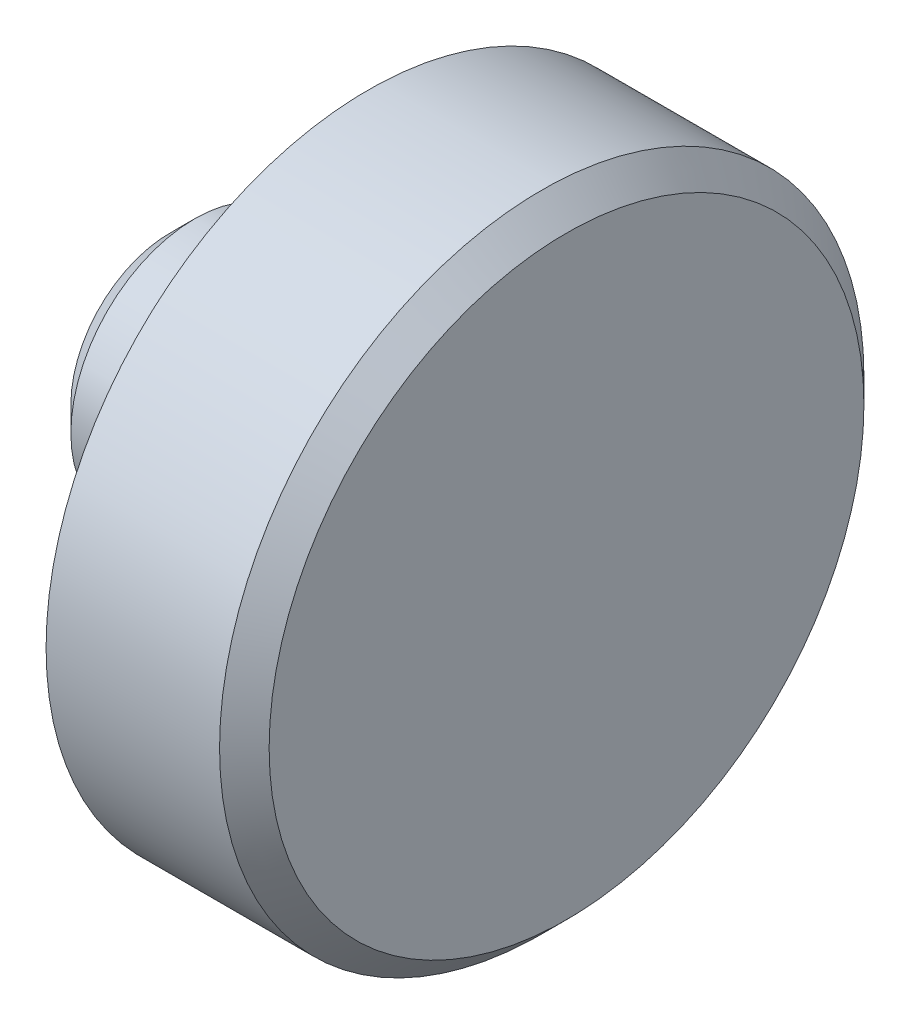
from build123d import *

# Parameters (mm, degrees)
CHANFREIN1_SIZE = 0.5


with BuildPart() as part:
    # Esquisse1 → R_volution1 (revolve)
    with BuildSketch(Plane.XY, mode=Mode.PRIVATE) as r_volution1_sk:
        Polygon((0, 0), (0, 6.5), (-4, 6.5), (-4, 2.5), (-8, 2.5), (-8, 0), align=None)
    revolve(r_volution1_sk.sketch.rotate(Axis((0, 0, 0), (-1, 0, 0)), 90), axis=Axis((0, 0, 0), (-1, 0, 0)))

    # Chanfrein1
    chanfrein1_edges = [part.edges().sort_by_distance(p)[0] for p in [
        (-8, 0, 2.5),
        (0, 0, 6.5),
    ]]
    chamfer(chanfrein1_edges, length=CHANFREIN1_SIZE)


solid = part.part
